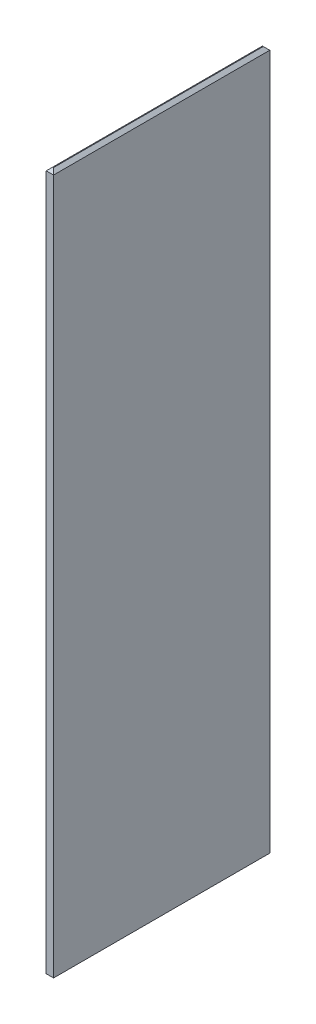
from build123d import *

# Parameters (mm, degrees)
SKETCH1_W           = 101.6
SKETCH1_H           = 3000
BOSS_EXTRUDE1_DEPTH = 9739.6
CHAMFER1_SIZE       = 45


with BuildPart() as part:
    # Sketch1 → Boss-Extrude1 (new body)
    with BuildSketch(Plane(origin=(0, 0, 0), x_dir=(-1, 0, 0), z_dir=(0, 1, 0))):
        Rectangle(SKETCH1_W, SKETCH1_H)
    extrude(amount=BOSS_EXTRUDE1_DEPTH)

    # Chamfer1
    chamfer1_edges = [part.edges().sort_by_distance(p)[0] for p in [
        (50.8, 9739.6, 0),
        (0, 9739.6, -1500),
        (-50.8, 9739.6, 0),
        (0, 0, -1500),
        (50.8, 0, 0),
        (0, 0, 1500),
        (-50.8, 0, 0),
        (0, 9739.6, 1500),
    ]]
    chamfer(chamfer1_edges, length=CHAMFER1_SIZE)


solid = part.part
